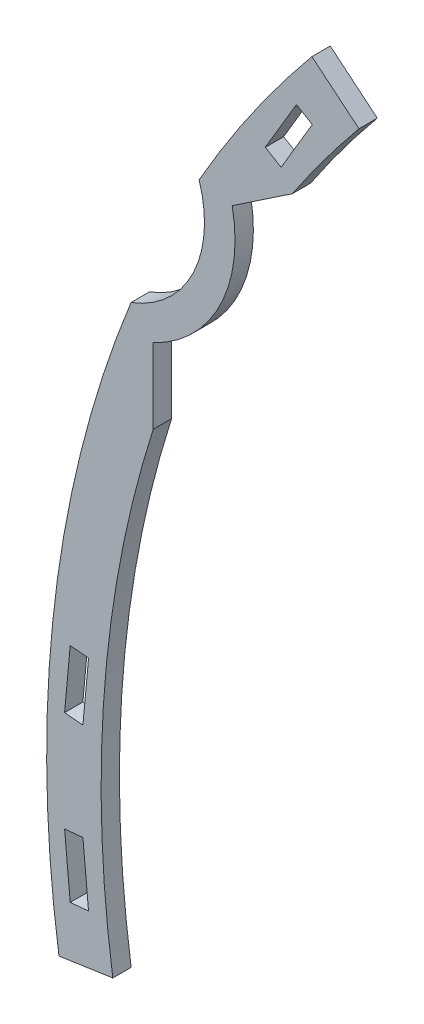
ISO-10303-21;
HEADER;
FILE_DESCRIPTION(('STEP AP214'),'2;1');
FILE_NAME('part.step','',(''),(''),'','','');
FILE_SCHEMA(('AUTOMOTIVE_DESIGN { 1 0 10303 214 1 1 1 1 }'));
ENDSEC;
DATA;
#1=APPLICATION_CONTEXT('core data for automotive mechanical design processes');
#2=APPLICATION_PROTOCOL_DEFINITION('international standard','automotive_design',2000,#1);
#3=PRODUCT_CONTEXT('',#1,'mechanical');
#4=PRODUCT('Part','Part','',(#3));
#5=PRODUCT_RELATED_PRODUCT_CATEGORY('part','',(#4));
#6=PRODUCT_DEFINITION_FORMATION('','',#4);
#7=PRODUCT_DEFINITION_CONTEXT('part definition',#1,'design');
#8=PRODUCT_DEFINITION('design','',#6,#7);
#9=PRODUCT_DEFINITION_SHAPE('','',#8);
#10=(LENGTH_UNIT() NAMED_UNIT(*) SI_UNIT(.MILLI.,.METRE.));
#11=(NAMED_UNIT(*) PLANE_ANGLE_UNIT() SI_UNIT($,.RADIAN.));
#12=(NAMED_UNIT(*) SI_UNIT($,.STERADIAN.) SOLID_ANGLE_UNIT());
#13=UNCERTAINTY_MEASURE_WITH_UNIT(LENGTH_MEASURE(1.E-05),#10,'distance_accuracy_value','');
#14=(GEOMETRIC_REPRESENTATION_CONTEXT(3) GLOBAL_UNCERTAINTY_ASSIGNED_CONTEXT((#13)) GLOBAL_UNIT_ASSIGNED_CONTEXT((#10,
#11,#12)) REPRESENTATION_CONTEXT('',''));
#15=CARTESIAN_POINT('',(0.,0.,0.));
#16=DIRECTION('',(0.,0.,1.));
#17=DIRECTION('',(1.,0.,0.));
#18=AXIS2_PLACEMENT_3D('',#15,#16,#17);
#19=CARTESIAN_POINT('',(-0.203284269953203,2.2058705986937,3.));
#20=DIRECTION('',(-0.091767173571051,0.995780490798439,0.));
#21=DIRECTION('',(-0.995780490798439,-0.091767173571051,0.));
#22=AXIS2_PLACEMENT_3D('',#19,#20,#21);
#23=PLANE('',#22);
#24=DIRECTION('',(0.995780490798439,0.091767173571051,0.));
#25=VECTOR('',#24,1.);
#26=CARTESIAN_POINT('',(-0.203284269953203,2.2058705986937,0.));
#27=LINE('',#26,#25);
#28=CARTESIAN_POINT('',(-186.36625925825,-14.9501695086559,0.));
#29=VERTEX_POINT('',#28);
#30=CARTESIAN_POINT('',(-183.36625925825,-14.6737014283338,0.));
#31=VERTEX_POINT('',#30);
#32=EDGE_CURVE('E266',#29,#31,#27,.T.);
#33=ORIENTED_EDGE('',*,*,#32,.T.);
#34=DIRECTION('',(0.,0.,-1.));
#35=VECTOR('',#34,1.);
#36=CARTESIAN_POINT('',(-183.36625925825,-14.6737014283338,3.));
#37=LINE('',#36,#35);
#38=CARTESIAN_POINT('',(-183.36625925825,-14.6737014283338,3.));
#39=VERTEX_POINT('',#38);
#40=EDGE_CURVE('E11',#39,#31,#37,.T.);
#41=ORIENTED_EDGE('',*,*,#40,.F.);
#42=DIRECTION('',(0.995780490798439,0.091767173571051,0.));
#43=VECTOR('',#42,1.);
#44=CARTESIAN_POINT('',(-0.203284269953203,2.2058705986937,3.));
#45=LINE('',#44,#43);
#46=CARTESIAN_POINT('',(-186.36625925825,-14.9501695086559,3.));
#47=VERTEX_POINT('',#46);
#48=EDGE_CURVE('E198',#47,#39,#45,.T.);
#49=ORIENTED_EDGE('',*,*,#48,.F.);
#50=DIRECTION('',(0.,0.,-1.));
#51=VECTOR('',#50,1.);
#52=CARTESIAN_POINT('',(-186.36625925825,-14.9501695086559,3.));
#53=LINE('',#52,#51);
#54=EDGE_CURVE('E54',#47,#29,#53,.T.);
#55=ORIENTED_EDGE('',*,*,#54,.T.);
#56=EDGE_LOOP('',(#33,#41,#49,#55));
#57=FACE_BOUND('',#56,.T.);
#58=ADVANCED_FACE('F35',(#57),#23,.F.);
#59=CARTESIAN_POINT('',(-183.162974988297,-16.8795720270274,3.));
#60=DIRECTION('',(0.995780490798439,0.0917671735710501,0.));
#61=DIRECTION('',(-0.0917671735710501,0.995780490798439,0.));
#62=AXIS2_PLACEMENT_3D('',#59,#60,#61);
#63=PLANE('',#62);
#64=DIRECTION('',(0.0917671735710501,-0.995780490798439,0.));
#65=VECTOR('',#64,1.);
#66=CARTESIAN_POINT('',(-183.162974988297,-16.8795720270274,0.));
#67=LINE('',#66,#65);
#68=CARTESIAN_POINT('',(-182.44858752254,-24.6315063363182,0.));
#69=VERTEX_POINT('',#68);
#70=EDGE_CURVE('E204',#31,#69,#67,.T.);
#71=ORIENTED_EDGE('',*,*,#70,.T.);
#72=DIRECTION('',(0.,0.,-1.));
#73=VECTOR('',#72,1.);
#74=CARTESIAN_POINT('',(-182.44858752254,-24.6315063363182,3.));
#75=LINE('',#74,#73);
#76=CARTESIAN_POINT('',(-182.44858752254,-24.6315063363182,3.));
#77=VERTEX_POINT('',#76);
#78=EDGE_CURVE('E45',#77,#69,#75,.T.);
#79=ORIENTED_EDGE('',*,*,#78,.F.);
#80=DIRECTION('',(0.0917671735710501,-0.995780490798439,0.));
#81=VECTOR('',#80,1.);
#82=CARTESIAN_POINT('',(-183.162974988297,-16.8795720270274,3.));
#83=LINE('',#82,#81);
#84=EDGE_CURVE('E192',#39,#77,#83,.T.);
#85=ORIENTED_EDGE('',*,*,#84,.F.);
#86=ORIENTED_EDGE('',*,*,#40,.T.);
#87=EDGE_LOOP('',(#71,#79,#85,#86));
#88=FACE_BOUND('',#87,.T.);
#89=ADVANCED_FACE('F203',(#88),#63,.F.);
#90=CARTESIAN_POINT('',(0.714387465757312,-7.7519343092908,3.));
#91=DIRECTION('',(-0.0917671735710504,0.995780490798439,0.));
#92=DIRECTION('',(-0.995780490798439,-0.0917671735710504,0.));
#93=AXIS2_PLACEMENT_3D('',#90,#91,#92);
#94=PLANE('',#93);
#95=DIRECTION('',(0.995780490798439,0.0917671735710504,0.));
#96=VECTOR('',#95,1.);
#97=CARTESIAN_POINT('',(0.714387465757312,-7.7519343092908,0.));
#98=LINE('',#97,#96);
#99=CARTESIAN_POINT('',(-185.44858752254,-24.9079744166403,0.));
#100=VERTEX_POINT('',#99);
#101=EDGE_CURVE('E269',#100,#69,#98,.T.);
#102=ORIENTED_EDGE('',*,*,#101,.F.);
#103=DIRECTION('',(0.,0.,-1.));
#104=VECTOR('',#103,1.);
#105=CARTESIAN_POINT('',(-185.44858752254,-24.9079744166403,3.));
#106=LINE('',#105,#104);
#107=CARTESIAN_POINT('',(-185.44858752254,-24.9079744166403,3.));
#108=VERTEX_POINT('',#107);
#109=EDGE_CURVE('E122',#108,#100,#106,.T.);
#110=ORIENTED_EDGE('',*,*,#109,.F.);
#111=DIRECTION('',(0.995780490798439,0.0917671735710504,0.));
#112=VECTOR('',#111,1.);
#113=CARTESIAN_POINT('',(0.714387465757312,-7.7519343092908,3.));
#114=LINE('',#113,#112);
#115=EDGE_CURVE('E197',#108,#77,#114,.T.);
#116=ORIENTED_EDGE('',*,*,#115,.T.);
#117=ORIENTED_EDGE('',*,*,#78,.T.);
#118=EDGE_LOOP('',(#102,#110,#116,#117));
#119=FACE_BOUND('',#118,.T.);
#120=ADVANCED_FACE('F208',(#119),#94,.T.);
#121=CARTESIAN_POINT('',(-0.512015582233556,-5.55596416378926,3.));
#122=DIRECTION('',(0.0917671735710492,0.995780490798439,0.));
#123=DIRECTION('',(-0.99578049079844,0.0917671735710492,0.));
#124=AXIS2_PLACEMENT_3D('',#121,#122,#123);
#125=PLANE('',#124);
#126=DIRECTION('',(0.995780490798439,-0.0917671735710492,0.));
#127=VECTOR('',#126,1.);
#128=CARTESIAN_POINT('',(-0.512015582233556,-5.55596416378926,0.));
#129=LINE('',#128,#127);
#130=CARTESIAN_POINT('',(-185.448587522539,11.4870555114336,0.));
#131=VERTEX_POINT('',#130);
#132=CARTESIAN_POINT('',(-182.448587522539,11.2105874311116,0.));
#133=VERTEX_POINT('',#132);
#134=EDGE_CURVE('E254',#131,#133,#129,.T.);
#135=ORIENTED_EDGE('',*,*,#134,.T.);
#136=DIRECTION('',(0.,0.,-1.));
#137=VECTOR('',#136,1.);
#138=CARTESIAN_POINT('',(-182.448587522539,11.2105874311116,3.));
#139=LINE('',#138,#137);
#140=CARTESIAN_POINT('',(-182.448587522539,11.2105874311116,3.));
#141=VERTEX_POINT('',#140);
#142=EDGE_CURVE('E276',#141,#133,#139,.T.);
#143=ORIENTED_EDGE('',*,*,#142,.F.);
#144=DIRECTION('',(0.995780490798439,-0.0917671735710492,0.));
#145=VECTOR('',#144,1.);
#146=CARTESIAN_POINT('',(-0.512015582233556,-5.55596416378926,3.));
#147=LINE('',#146,#145);
#148=CARTESIAN_POINT('',(-185.448587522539,11.4870555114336,3.));
#149=VERTEX_POINT('',#148);
#150=EDGE_CURVE('E392',#149,#141,#147,.T.);
#151=ORIENTED_EDGE('',*,*,#150,.F.);
#152=DIRECTION('',(0.,0.,-1.));
#153=VECTOR('',#152,1.);
#154=CARTESIAN_POINT('',(-185.448587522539,11.4870555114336,3.));
#155=LINE('',#154,#153);
#156=EDGE_CURVE('E278',#149,#131,#155,.T.);
#157=ORIENTED_EDGE('',*,*,#156,.T.);
#158=EDGE_LOOP('',(#135,#143,#151,#157));
#159=FACE_BOUND('',#158,.T.);
#160=ADVANCED_FACE('F418',(#159),#125,.F.);
#161=CARTESIAN_POINT('',(-181.936571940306,16.7665515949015,3.));
#162=DIRECTION('',(0.995780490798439,-0.0917671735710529,0.));
#163=DIRECTION('',(0.0917671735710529,0.995780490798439,0.));
#164=AXIS2_PLACEMENT_3D('',#161,#162,#163);
#165=PLANE('',#164);
#166=DIRECTION('',(-0.0917671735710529,-0.995780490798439,0.));
#167=VECTOR('',#166,1.);
#168=CARTESIAN_POINT('',(-181.936571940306,16.7665515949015,0.));
#169=LINE('',#168,#167);
#170=CARTESIAN_POINT('',(-183.36625925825,1.25278252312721,0.));
#171=VERTEX_POINT('',#170);
#172=EDGE_CURVE('E257',#133,#171,#169,.T.);
#173=ORIENTED_EDGE('',*,*,#172,.T.);
#174=DIRECTION('',(0.,0.,-1.));
#175=VECTOR('',#174,1.);
#176=CARTESIAN_POINT('',(-183.36625925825,1.25278252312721,3.));
#177=LINE('',#176,#175);
#178=CARTESIAN_POINT('',(-183.36625925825,1.25278252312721,3.));
#179=VERTEX_POINT('',#178);
#180=EDGE_CURVE('E283',#179,#171,#177,.T.);
#181=ORIENTED_EDGE('',*,*,#180,.F.);
#182=DIRECTION('',(-0.0917671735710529,-0.995780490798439,0.));
#183=VECTOR('',#182,1.);
#184=CARTESIAN_POINT('',(-181.936571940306,16.7665515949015,3.));
#185=LINE('',#184,#183);
#186=EDGE_CURVE('E395',#141,#179,#185,.T.);
#187=ORIENTED_EDGE('',*,*,#186,.F.);
#188=ORIENTED_EDGE('',*,*,#142,.T.);
#189=EDGE_LOOP('',(#173,#181,#187,#188));
#190=FACE_BOUND('',#189,.T.);
#191=ADVANCED_FACE('F420',(#190),#165,.F.);
#192=CARTESIAN_POINT('',(-1.42968731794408,-15.5137690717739,3.));
#193=DIRECTION('',(0.0917671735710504,0.995780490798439,0.));
#194=DIRECTION('',(-0.995780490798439,0.0917671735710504,0.));
#195=AXIS2_PLACEMENT_3D('',#192,#193,#194);
#196=PLANE('',#195);
#197=DIRECTION('',(0.995780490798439,-0.0917671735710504,0.));
#198=VECTOR('',#197,1.);
#199=CARTESIAN_POINT('',(-1.42968731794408,-15.5137690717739,0.));
#200=LINE('',#199,#198);
#201=CARTESIAN_POINT('',(-186.36625925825,1.52925060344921,0.));
#202=VERTEX_POINT('',#201);
#203=EDGE_CURVE('E260',#202,#171,#200,.T.);
#204=ORIENTED_EDGE('',*,*,#203,.F.);
#205=DIRECTION('',(0.,0.,-1.));
#206=VECTOR('',#205,1.);
#207=CARTESIAN_POINT('',(-186.36625925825,1.52925060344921,3.));
#208=LINE('',#207,#206);
#209=CARTESIAN_POINT('',(-186.36625925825,1.52925060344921,3.));
#210=VERTEX_POINT('',#209);
#211=EDGE_CURVE('E280',#210,#202,#208,.T.);
#212=ORIENTED_EDGE('',*,*,#211,.F.);
#213=DIRECTION('',(0.995780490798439,-0.0917671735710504,0.));
#214=VECTOR('',#213,1.);
#215=CARTESIAN_POINT('',(-1.42968731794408,-15.5137690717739,3.));
#216=LINE('',#215,#214);
#217=EDGE_CURVE('E397',#210,#179,#216,.T.);
#218=ORIENTED_EDGE('',*,*,#217,.T.);
#219=ORIENTED_EDGE('',*,*,#180,.T.);
#220=EDGE_LOOP('',(#204,#212,#218,#219));
#221=FACE_BOUND('',#220,.T.);
#222=ADVANCED_FACE('F413',(#221),#196,.T.);
#223=CARTESIAN_POINT('',(-154.080393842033,91.2060137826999,3.));
#224=DIRECTION('',(-0.860538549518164,0.509385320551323,0.));
#225=DIRECTION('',(-0.509385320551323,-0.860538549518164,0.));
#226=AXIS2_PLACEMENT_3D('',#223,#224,#225);
#227=PLANE('',#226);
#228=DIRECTION('',(0.509385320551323,0.860538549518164,0.));
#229=VECTOR('',#228,1.);
#230=CARTESIAN_POINT('',(-154.080393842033,91.2060137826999,0.));
#231=LINE('',#230,#229);
#232=CARTESIAN_POINT('',(-150.926255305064,96.5345100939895,0.));
#233=VERTEX_POINT('',#232);
#234=CARTESIAN_POINT('',(-145.832402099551,105.139895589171,0.));
#235=VERTEX_POINT('',#234);
#236=EDGE_CURVE('E242',#233,#235,#231,.T.);
#237=ORIENTED_EDGE('',*,*,#236,.F.);
#238=DIRECTION('',(0.,0.,-1.));
#239=VECTOR('',#238,1.);
#240=CARTESIAN_POINT('',(-150.926255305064,96.5345100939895,3.));
#241=LINE('',#240,#239);
#242=CARTESIAN_POINT('',(-150.926255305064,96.5345100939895,3.));
#243=VERTEX_POINT('',#242);
#244=EDGE_CURVE('E281',#243,#233,#241,.T.);
#245=ORIENTED_EDGE('',*,*,#244,.F.);
#246=DIRECTION('',(0.509385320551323,0.860538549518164,0.));
#247=VECTOR('',#246,1.);
#248=CARTESIAN_POINT('',(-154.080393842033,91.2060137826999,3.));
#249=LINE('',#248,#247);
#250=CARTESIAN_POINT('',(-145.832402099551,105.139895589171,3.));
#251=VERTEX_POINT('',#250);
#252=EDGE_CURVE('E381',#243,#251,#249,.T.);
#253=ORIENTED_EDGE('',*,*,#252,.T.);
#254=DIRECTION('',(0.,0.,-1.));
#255=VECTOR('',#254,1.);
#256=CARTESIAN_POINT('',(-145.832402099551,105.139895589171,3.));
#257=LINE('',#256,#255);
#258=EDGE_CURVE('E287',#251,#235,#257,.T.);
#259=ORIENTED_EDGE('',*,*,#258,.T.);
#260=EDGE_LOOP('',(#237,#245,#253,#259));
#261=FACE_BOUND('',#260,.T.);
#262=ADVANCED_FACE('F427',(#261),#227,.T.);
#263=CARTESIAN_POINT('',(3.15413853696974,5.32849631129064,3.));
#264=DIRECTION('',(0.509385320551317,0.860538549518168,0.));
#265=DIRECTION('',(-0.860538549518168,0.509385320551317,0.));
#266=AXIS2_PLACEMENT_3D('',#263,#264,#265);
#267=PLANE('',#266);
#268=DIRECTION('',(0.860538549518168,-0.509385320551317,0.));
#269=VECTOR('',#268,1.);
#270=CARTESIAN_POINT('',(3.15413853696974,5.32849631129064,0.));
#271=LINE('',#270,#269);
#272=CARTESIAN_POINT('',(-153.51881026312,98.0691414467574,0.));
#273=VERTEX_POINT('',#272);
#274=EDGE_CURVE('E245',#273,#233,#271,.T.);
#275=ORIENTED_EDGE('',*,*,#274,.F.);
#276=DIRECTION('',(0.,0.,-1.));
#277=VECTOR('',#276,1.);
#278=CARTESIAN_POINT('',(-153.51881026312,98.0691414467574,3.));
#279=LINE('',#278,#277);
#280=CARTESIAN_POINT('',(-153.51881026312,98.0691414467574,3.));
#281=VERTEX_POINT('',#280);
#282=EDGE_CURVE('E292',#281,#273,#279,.T.);
#283=ORIENTED_EDGE('',*,*,#282,.F.);
#284=DIRECTION('',(0.860538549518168,-0.509385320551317,0.));
#285=VECTOR('',#284,1.);
#286=CARTESIAN_POINT('',(3.15413853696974,5.32849631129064,3.));
#287=LINE('',#286,#285);
#288=EDGE_CURVE('E384',#281,#243,#287,.T.);
#289=ORIENTED_EDGE('',*,*,#288,.T.);
#290=ORIENTED_EDGE('',*,*,#244,.T.);
#291=EDGE_LOOP('',(#275,#283,#289,#290));
#292=FACE_BOUND('',#291,.T.);
#293=ADVANCED_FACE('F472',(#292),#267,.T.);
#294=CARTESIAN_POINT('',(-156.672948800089,92.7406451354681,3.));
#295=DIRECTION('',(-0.860538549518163,0.509385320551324,0.));
#296=DIRECTION('',(-0.509385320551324,-0.860538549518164,0.));
#297=AXIS2_PLACEMENT_3D('',#294,#295,#296);
#298=PLANE('',#297);
#299=DIRECTION('',(0.509385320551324,0.860538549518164,0.));
#300=VECTOR('',#299,1.);
#301=CARTESIAN_POINT('',(-156.672948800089,92.7406451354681,0.));
#302=LINE('',#301,#300);
#303=CARTESIAN_POINT('',(-148.424957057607,106.674526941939,0.));
#304=VERTEX_POINT('',#303);
#305=EDGE_CURVE('E248',#273,#304,#302,.T.);
#306=ORIENTED_EDGE('',*,*,#305,.T.);
#307=DIRECTION('',(0.,0.,-1.));
#308=VECTOR('',#307,1.);
#309=CARTESIAN_POINT('',(-148.424957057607,106.674526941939,3.));
#310=LINE('',#309,#308);
#311=CARTESIAN_POINT('',(-148.424957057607,106.674526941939,3.));
#312=VERTEX_POINT('',#311);
#313=EDGE_CURVE('E289',#312,#304,#310,.T.);
#314=ORIENTED_EDGE('',*,*,#313,.F.);
#315=DIRECTION('',(0.509385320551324,0.860538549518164,0.));
#316=VECTOR('',#315,1.);
#317=CARTESIAN_POINT('',(-156.672948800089,92.7406451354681,3.));
#318=LINE('',#317,#316);
#319=EDGE_CURVE('E387',#281,#312,#318,.T.);
#320=ORIENTED_EDGE('',*,*,#319,.F.);
#321=ORIENTED_EDGE('',*,*,#282,.T.);
#322=EDGE_LOOP('',(#306,#314,#320,#321));
#323=FACE_BOUND('',#322,.T.);
#324=ADVANCED_FACE('F468',(#323),#298,.F.);
#325=CARTESIAN_POINT('',(0.,-5.88022373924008,3.));
#326=DIRECTION('',(0.,0.,-1.));
#327=DIRECTION('',(-1.,0.,0.));
#328=AXIS2_PLACEMENT_3D('',#325,#326,#327);
#329=CYLINDRICAL_SURFACE('',#328,180.393138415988);
#330=CARTESIAN_POINT('',(0.,-5.88022373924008,0.));
#331=DIRECTION('',(0.,0.,1.));
#332=DIRECTION('',(1.,0.,0.));
#333=AXIS2_PLACEMENT_3D('',#330,#331,#332);
#334=CIRCLE('',#333,180.393138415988);
#335=CARTESIAN_POINT('',(-171.863347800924,48.9346836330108,0.));
#336=VERTEX_POINT('',#335);
#337=CARTESIAN_POINT('',(-178.471928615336,-32.1377004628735,0.));
#338=VERTEX_POINT('',#337);
#339=EDGE_CURVE('E215',#336,#338,#334,.T.);
#340=ORIENTED_EDGE('',*,*,#339,.F.);
#341=DIRECTION('',(0.,0.,-1.));
#342=VECTOR('',#341,1.);
#343=CARTESIAN_POINT('',(-171.863347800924,48.9346836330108,3.));
#344=LINE('',#343,#342);
#345=CARTESIAN_POINT('',(-171.863347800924,48.9346836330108,3.));
#346=VERTEX_POINT('',#345);
#347=EDGE_CURVE('E39',#346,#336,#344,.T.);
#348=ORIENTED_EDGE('',*,*,#347,.F.);
#349=CARTESIAN_POINT('',(0.,-5.88022373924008,3.));
#350=DIRECTION('',(0.,0.,1.));
#351=DIRECTION('',(1.,0.,0.));
#352=AXIS2_PLACEMENT_3D('',#349,#350,#351);
#353=CIRCLE('',#352,180.393138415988);
#354=CARTESIAN_POINT('',(-178.471928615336,-32.1377004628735,3.));
#355=VERTEX_POINT('',#354);
#356=EDGE_CURVE('E274',#346,#355,#353,.T.);
#357=ORIENTED_EDGE('',*,*,#356,.T.);
#358=DIRECTION('',(0.,0.,-1.));
#359=VECTOR('',#358,1.);
#360=CARTESIAN_POINT('',(-178.471928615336,-32.1377004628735,3.));
#361=LINE('',#360,#359);
#362=EDGE_CURVE('E211',#355,#338,#361,.T.);
#363=ORIENTED_EDGE('',*,*,#362,.T.);
#364=EDGE_LOOP('',(#340,#348,#357,#363));
#365=FACE_BOUND('',#364,.T.);
#366=ADVANCED_FACE('F37',(#365),#329,.F.);
#367=CARTESIAN_POINT('',(-171.863347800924,0.,3.));
#368=DIRECTION('',(-1.,0.,0.));
#369=DIRECTION('',(0.,0.,1.));
#370=AXIS2_PLACEMENT_3D('',#367,#368,#369);
#371=PLANE('',#370);
#372=DIRECTION('',(0.,1.,0.));
#373=VECTOR('',#372,1.);
#374=CARTESIAN_POINT('',(-171.863347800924,0.,0.));
#375=LINE('',#374,#373);
#376=CARTESIAN_POINT('',(-171.863347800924,61.2060859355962,0.));
#377=VERTEX_POINT('',#376);
#378=EDGE_CURVE('E218',#336,#377,#375,.T.);
#379=ORIENTED_EDGE('',*,*,#378,.T.);
#380=DIRECTION('',(0.,0.,-1.));
#381=VECTOR('',#380,1.);
#382=CARTESIAN_POINT('',(-171.863347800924,61.2060859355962,3.));
#383=LINE('',#382,#381);
#384=CARTESIAN_POINT('',(-171.863347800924,61.2060859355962,3.));
#385=VERTEX_POINT('',#384);
#386=EDGE_CURVE('E311',#385,#377,#383,.T.);
#387=ORIENTED_EDGE('',*,*,#386,.F.);
#388=DIRECTION('',(0.,1.,0.));
#389=VECTOR('',#388,1.);
#390=CARTESIAN_POINT('',(-171.863347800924,0.,3.));
#391=LINE('',#390,#389);
#392=EDGE_CURVE('E320',#346,#385,#391,.T.);
#393=ORIENTED_EDGE('',*,*,#392,.F.);
#394=ORIENTED_EDGE('',*,*,#347,.T.);
#395=EDGE_LOOP('',(#379,#387,#393,#394));
#396=FACE_BOUND('',#395,.T.);
#397=ADVANCED_FACE('F319',(#396),#371,.F.);
#398=CARTESIAN_POINT('',(-181.970238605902,82.4216641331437,3.));
#399=DIRECTION('',(0.,0.,-1.));
#400=DIRECTION('',(-1.,0.,0.));
#401=AXIS2_PLACEMENT_3D('',#398,#399,#400);
#402=CYLINDRICAL_SURFACE('',#401,23.5);
#403=CARTESIAN_POINT('',(-181.970238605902,82.4216641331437,0.));
#404=DIRECTION('',(0.,0.,1.));
#405=DIRECTION('',(1.,0.,0.));
#406=AXIS2_PLACEMENT_3D('',#403,#404,#405);
#407=CIRCLE('',#406,23.5);
#408=CARTESIAN_POINT('',(-158.939001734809,87.0920097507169,0.));
#409=VERTEX_POINT('',#408);
#410=EDGE_CURVE('E220',#377,#409,#407,.T.);
#411=ORIENTED_EDGE('',*,*,#410,.T.);
#412=DIRECTION('',(0.,0.,-1.));
#413=VECTOR('',#412,1.);
#414=CARTESIAN_POINT('',(-158.939001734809,87.0920097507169,3.));
#415=LINE('',#414,#413);
#416=CARTESIAN_POINT('',(-158.939001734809,87.0920097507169,3.));
#417=VERTEX_POINT('',#416);
#418=EDGE_CURVE('E309',#417,#409,#415,.T.);
#419=ORIENTED_EDGE('',*,*,#418,.F.);
#420=CARTESIAN_POINT('',(-181.970238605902,82.4216641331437,3.));
#421=DIRECTION('',(0.,0.,1.));
#422=DIRECTION('',(1.,0.,0.));
#423=AXIS2_PLACEMENT_3D('',#420,#421,#422);
#424=CIRCLE('',#423,23.5);
#425=EDGE_CURVE('E364',#385,#417,#424,.T.);
#426=ORIENTED_EDGE('',*,*,#425,.F.);
#427=ORIENTED_EDGE('',*,*,#386,.T.);
#428=EDGE_LOOP('',(#411,#419,#426,#427));
#429=FACE_BOUND('',#428,.T.);
#430=ADVANCED_FACE('F363',(#429),#402,.T.);
#431=CARTESIAN_POINT('',(-89.6874811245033,133.586268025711,3.));
#432=DIRECTION('',(-0.557407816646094,0.830238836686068,0.));
#433=DIRECTION('',(-0.830238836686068,-0.557407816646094,0.));
#434=AXIS2_PLACEMENT_3D('',#431,#432,#433);
#435=PLANE('',#434);
#436=DIRECTION('',(0.830238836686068,0.557407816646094,0.));
#437=VECTOR('',#436,1.);
#438=CARTESIAN_POINT('',(-89.6874811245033,133.586268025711,0.));
#439=LINE('',#438,#437);
#440=CARTESIAN_POINT('',(-149.111601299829,93.6899543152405,0.));
#441=VERTEX_POINT('',#440);
#442=EDGE_CURVE('E222',#409,#441,#439,.T.);
#443=ORIENTED_EDGE('',*,*,#442,.T.);
#444=DIRECTION('',(0.,0.,-1.));
#445=VECTOR('',#444,1.);
#446=CARTESIAN_POINT('',(-149.111601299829,93.6899543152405,3.));
#447=LINE('',#446,#445);
#448=CARTESIAN_POINT('',(-149.111601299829,93.6899543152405,3.));
#449=VERTEX_POINT('',#448);
#450=EDGE_CURVE('E307',#449,#441,#447,.T.);
#451=ORIENTED_EDGE('',*,*,#450,.F.);
#452=DIRECTION('',(0.830238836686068,0.557407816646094,0.));
#453=VECTOR('',#452,1.);
#454=CARTESIAN_POINT('',(-89.6874811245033,133.586268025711,3.));
#455=LINE('',#454,#453);
#456=EDGE_CURVE('E362',#417,#449,#455,.T.);
#457=ORIENTED_EDGE('',*,*,#456,.F.);
#458=ORIENTED_EDGE('',*,*,#418,.T.);
#459=EDGE_LOOP('',(#443,#451,#457,#458));
#460=FACE_BOUND('',#459,.T.);
#461=ADVANCED_FACE('F359',(#460),#435,.F.);
#462=CARTESIAN_POINT('',(0.,-5.88022373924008,3.));
#463=DIRECTION('',(0.,0.,-1.));
#464=DIRECTION('',(-1.,0.,0.));
#465=AXIS2_PLACEMENT_3D('',#462,#463,#464);
#466=CYLINDRICAL_SURFACE('',#465,179.3);
#467=CARTESIAN_POINT('',(0.,-5.88022373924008,0.));
#468=DIRECTION('',(0.,0.,1.));
#469=DIRECTION('',(1.,0.,0.));
#470=AXIS2_PLACEMENT_3D('',#467,#468,#469);
#471=CIRCLE('',#470,179.3);
#472=CARTESIAN_POINT('',(-138.186060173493,108.369952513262,0.));
#473=VERTEX_POINT('',#472);
#474=EDGE_CURVE('E225',#473,#441,#471,.T.);
#475=ORIENTED_EDGE('',*,*,#474,.F.);
#476=DIRECTION('',(0.,0.,-1.));
#477=VECTOR('',#476,1.);
#478=CARTESIAN_POINT('',(-138.186060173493,108.369952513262,3.));
#479=LINE('',#478,#477);
#480=CARTESIAN_POINT('',(-138.186060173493,108.369952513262,3.));
#481=VERTEX_POINT('',#480);
#482=EDGE_CURVE('E305',#481,#473,#479,.T.);
#483=ORIENTED_EDGE('',*,*,#482,.F.);
#484=CARTESIAN_POINT('',(0.,-5.88022373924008,3.));
#485=DIRECTION('',(0.,0.,1.));
#486=DIRECTION('',(1.,0.,0.));
#487=AXIS2_PLACEMENT_3D('',#484,#485,#486);
#488=CIRCLE('',#487,179.3);
#489=EDGE_CURVE('E367',#481,#449,#488,.T.);
#490=ORIENTED_EDGE('',*,*,#489,.T.);
#491=ORIENTED_EDGE('',*,*,#450,.T.);
#492=EDGE_LOOP('',(#475,#483,#490,#491));
#493=FACE_BOUND('',#492,.T.);
#494=ADVANCED_FACE('F356',(#493),#466,.F.);
#495=CARTESIAN_POINT('',(-2.88771537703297,-3.49270367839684,3.));
#496=DIRECTION('',(0.63720120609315,0.770697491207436,0.));
#497=DIRECTION('',(-0.770697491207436,0.63720120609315,0.));
#498=AXIS2_PLACEMENT_3D('',#495,#496,#497);
#499=PLANE('',#498);
#500=DIRECTION('',(0.770697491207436,-0.63720120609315,0.));
#501=VECTOR('',#500,1.);
#502=CARTESIAN_POINT('',(-2.88771537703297,-3.49270367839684,0.));
#503=LINE('',#502,#501);
#504=CARTESIAN_POINT('',(-145.893035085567,114.741964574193,0.));
#505=VERTEX_POINT('',#504);
#506=EDGE_CURVE('E228',#505,#473,#503,.T.);
#507=ORIENTED_EDGE('',*,*,#506,.F.);
#508=DIRECTION('',(0.,0.,-1.));
#509=VECTOR('',#508,1.);
#510=CARTESIAN_POINT('',(-145.893035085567,114.741964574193,3.));
#511=LINE('',#510,#509);
#512=CARTESIAN_POINT('',(-145.893035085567,114.741964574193,3.));
#513=VERTEX_POINT('',#512);
#514=EDGE_CURVE('E303',#513,#505,#511,.T.);
#515=ORIENTED_EDGE('',*,*,#514,.F.);
#516=DIRECTION('',(0.770697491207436,-0.63720120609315,0.));
#517=VECTOR('',#516,1.);
#518=CARTESIAN_POINT('',(-2.88771537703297,-3.49270367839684,3.));
#519=LINE('',#518,#517);
#520=EDGE_CURVE('E352',#513,#481,#519,.T.);
#521=ORIENTED_EDGE('',*,*,#520,.T.);
#522=ORIENTED_EDGE('',*,*,#482,.T.);
#523=EDGE_LOOP('',(#507,#515,#521,#522));
#524=FACE_BOUND('',#523,.T.);
#525=ADVANCED_FACE('F348',(#524),#499,.T.);
#526=CARTESIAN_POINT('',(0.,-5.88022373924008,3.));
#527=DIRECTION('',(0.,0.,-1.));
#528=DIRECTION('',(-1.,0.,0.));
#529=AXIS2_PLACEMENT_3D('',#526,#527,#528);
#530=CYLINDRICAL_SURFACE('',#529,189.3);
#531=CARTESIAN_POINT('',(0.,-5.88022373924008,0.));
#532=DIRECTION('',(0.,0.,1.));
#533=DIRECTION('',(1.,0.,0.));
#534=AXIS2_PLACEMENT_3D('',#531,#532,#533);
#535=CIRCLE('',#534,189.3);
#536=CARTESIAN_POINT('',(-164.348940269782,88.0554767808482,0.));
#537=VERTEX_POINT('',#536);
#538=EDGE_CURVE('E231',#505,#537,#535,.T.);
#539=ORIENTED_EDGE('',*,*,#538,.T.);
#540=DIRECTION('',(0.,0.,-1.));
#541=VECTOR('',#540,1.);
#542=CARTESIAN_POINT('',(-164.348940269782,88.0554767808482,3.));
#543=LINE('',#542,#541);
#544=CARTESIAN_POINT('',(-164.348940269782,88.0554767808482,3.));
#545=VERTEX_POINT('',#544);
#546=EDGE_CURVE('E301',#545,#537,#543,.T.);
#547=ORIENTED_EDGE('',*,*,#546,.F.);
#548=CARTESIAN_POINT('',(0.,-5.88022373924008,3.));
#549=DIRECTION('',(0.,0.,1.));
#550=DIRECTION('',(1.,0.,0.));
#551=AXIS2_PLACEMENT_3D('',#548,#549,#550);
#552=CIRCLE('',#551,189.3);
#553=EDGE_CURVE('E374',#513,#545,#552,.T.);
#554=ORIENTED_EDGE('',*,*,#553,.F.);
#555=ORIENTED_EDGE('',*,*,#514,.T.);
#556=EDGE_LOOP('',(#539,#547,#554,#555));
#557=FACE_BOUND('',#556,.T.);
#558=ADVANCED_FACE('F345',(#557),#530,.T.);
#559=CARTESIAN_POINT('',(-181.970238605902,82.4216641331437,3.));
#560=DIRECTION('',(0.,0.,-1.));
#561=DIRECTION('',(-1.,0.,0.));
#562=AXIS2_PLACEMENT_3D('',#559,#560,#561);
#563=CYLINDRICAL_SURFACE('',#562,18.5);
#564=CARTESIAN_POINT('',(-181.970238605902,82.4216641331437,0.));
#565=DIRECTION('',(0.,0.,1.));
#566=DIRECTION('',(1.,0.,0.));
#567=AXIS2_PLACEMENT_3D('',#564,#565,#566);
#568=CIRCLE('',#567,18.5);
#569=CARTESIAN_POINT('',(-175.491492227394,65.0931949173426,0.));
#570=VERTEX_POINT('',#569);
#571=EDGE_CURVE('E234',#570,#537,#568,.T.);
#572=ORIENTED_EDGE('',*,*,#571,.F.);
#573=DIRECTION('',(0.,0.,-1.));
#574=VECTOR('',#573,1.);
#575=CARTESIAN_POINT('',(-175.491492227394,65.0931949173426,3.));
#576=LINE('',#575,#574);
#577=CARTESIAN_POINT('',(-175.491492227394,65.0931949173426,3.));
#578=VERTEX_POINT('',#577);
#579=EDGE_CURVE('E299',#578,#570,#576,.T.);
#580=ORIENTED_EDGE('',*,*,#579,.F.);
#581=CARTESIAN_POINT('',(-181.970238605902,82.4216641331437,3.));
#582=DIRECTION('',(0.,0.,1.));
#583=DIRECTION('',(1.,0.,0.));
#584=AXIS2_PLACEMENT_3D('',#581,#582,#583);
#585=CIRCLE('',#584,18.5);
#586=EDGE_CURVE('E342',#578,#545,#585,.T.);
#587=ORIENTED_EDGE('',*,*,#586,.T.);
#588=ORIENTED_EDGE('',*,*,#546,.T.);
#589=EDGE_LOOP('',(#572,#580,#587,#588));
#590=FACE_BOUND('',#589,.T.);
#591=ADVANCED_FACE('F337',(#590),#563,.F.);
#592=CARTESIAN_POINT('',(0.,-5.88022373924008,3.));
#593=DIRECTION('',(0.,0.,-1.));
#594=DIRECTION('',(-1.,0.,0.));
#595=AXIS2_PLACEMENT_3D('',#592,#593,#594);
#596=CYLINDRICAL_SURFACE('',#595,189.3);
#597=CARTESIAN_POINT('',(0.,-5.88022373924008,0.));
#598=DIRECTION('',(0.,0.,1.));
#599=DIRECTION('',(1.,0.,0.));
#600=AXIS2_PLACEMENT_3D('',#597,#598,#599);
#601=CIRCLE('',#600,189.3);
#602=CARTESIAN_POINT('',(-187.283930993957,-33.4341561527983,0.));
#603=VERTEX_POINT('',#602);
#604=EDGE_CURVE('E237',#570,#603,#601,.T.);
#605=ORIENTED_EDGE('',*,*,#604,.T.);
#606=DIRECTION('',(0.,0.,-1.));
#607=VECTOR('',#606,1.);
#608=CARTESIAN_POINT('',(-187.283930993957,-33.4341561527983,3.));
#609=LINE('',#608,#607);
#610=CARTESIAN_POINT('',(-187.283930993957,-33.4341561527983,3.));
#611=VERTEX_POINT('',#610);
#612=EDGE_CURVE('E296',#611,#603,#609,.T.);
#613=ORIENTED_EDGE('',*,*,#612,.F.);
#614=CARTESIAN_POINT('',(0.,-5.88022373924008,3.));
#615=DIRECTION('',(0.,0.,1.));
#616=DIRECTION('',(1.,0.,0.));
#617=AXIS2_PLACEMENT_3D('',#614,#615,#616);
#618=CIRCLE('',#617,189.3);
#619=EDGE_CURVE('E377',#578,#611,#618,.T.);
#620=ORIENTED_EDGE('',*,*,#619,.F.);
#621=ORIENTED_EDGE('',*,*,#579,.T.);
#622=EDGE_LOOP('',(#605,#613,#620,#621));
#623=FACE_BOUND('',#622,.T.);
#624=ADVANCED_FACE('F440',(#623),#596,.T.);
#625=CARTESIAN_POINT('',(-184.936571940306,17.0430196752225,3.));
#626=DIRECTION('',(0.995780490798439,-0.0917671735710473,0.));
#627=DIRECTION('',(0.0917671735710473,0.99578049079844,0.));
#628=AXIS2_PLACEMENT_3D('',#625,#626,#627);
#629=PLANE('',#628);
#630=DIRECTION('',(-0.0917671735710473,-0.99578049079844,0.));
#631=VECTOR('',#630,1.);
#632=CARTESIAN_POINT('',(-184.936571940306,17.0430196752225,0.));
#633=LINE('',#632,#631);
#634=EDGE_CURVE('E263',#131,#202,#633,.T.);
#635=ORIENTED_EDGE('',*,*,#634,.F.);
#636=ORIENTED_EDGE('',*,*,#156,.F.);
#637=DIRECTION('',(-0.0917671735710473,-0.99578049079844,0.));
#638=VECTOR('',#637,1.);
#639=CARTESIAN_POINT('',(-184.936571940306,17.0430196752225,3.));
#640=LINE('',#639,#638);
#641=EDGE_CURVE('E400',#149,#210,#640,.T.);
#642=ORIENTED_EDGE('',*,*,#641,.T.);
#643=ORIENTED_EDGE('',*,*,#211,.T.);
#644=EDGE_LOOP('',(#635,#636,#642,#643));
#645=FACE_BOUND('',#644,.T.);
#646=ADVANCED_FACE('F405',(#645),#629,.T.);
#647=CARTESIAN_POINT('',(8.24799174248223,13.9338818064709,3.));
#648=DIRECTION('',(0.509385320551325,0.860538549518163,0.));
#649=DIRECTION('',(-0.860538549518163,0.509385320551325,0.));
#650=AXIS2_PLACEMENT_3D('',#647,#648,#649);
#651=PLANE('',#650);
#652=DIRECTION('',(0.860538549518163,-0.509385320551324,0.));
#653=VECTOR('',#652,1.);
#654=CARTESIAN_POINT('',(8.24799174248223,13.9338818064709,0.));
#655=LINE('',#654,#653);
#656=EDGE_CURVE('E251',#304,#235,#655,.T.);
#657=ORIENTED_EDGE('',*,*,#656,.T.);
#658=ORIENTED_EDGE('',*,*,#258,.F.);
#659=DIRECTION('',(0.860538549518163,-0.509385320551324,0.));
#660=VECTOR('',#659,1.);
#661=CARTESIAN_POINT('',(8.24799174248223,13.9338818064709,3.));
#662=LINE('',#661,#660);
#663=EDGE_CURVE('E390',#312,#251,#662,.T.);
#664=ORIENTED_EDGE('',*,*,#663,.F.);
#665=ORIENTED_EDGE('',*,*,#313,.T.);
#666=EDGE_LOOP('',(#657,#658,#664,#665));
#667=FACE_BOUND('',#666,.T.);
#668=ADVANCED_FACE('F439',(#667),#651,.F.);
#669=CARTESIAN_POINT('',(0.846791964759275,-5.75564044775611,3.));
#670=DIRECTION('',(-0.145556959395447,0.98934987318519,0.));
#671=DIRECTION('',(-0.98934987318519,-0.145556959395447,0.));
#672=AXIS2_PLACEMENT_3D('',#669,#670,#671);
#673=PLANE('',#672);
#674=DIRECTION('',(0.98934987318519,0.145556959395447,0.));
#675=VECTOR('',#674,1.);
#676=CARTESIAN_POINT('',(0.846791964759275,-5.75564044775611,0.));
#677=LINE('',#676,#675);
#678=EDGE_CURVE('E239',#603,#338,#677,.T.);
#679=ORIENTED_EDGE('',*,*,#678,.T.);
#680=ORIENTED_EDGE('',*,*,#362,.F.);
#681=DIRECTION('',(0.98934987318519,0.145556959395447,0.));
#682=VECTOR('',#681,1.);
#683=CARTESIAN_POINT('',(0.846791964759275,-5.75564044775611,3.));
#684=LINE('',#683,#682);
#685=EDGE_CURVE('E379',#611,#355,#684,.T.);
#686=ORIENTED_EDGE('',*,*,#685,.F.);
#687=ORIENTED_EDGE('',*,*,#612,.T.);
#688=EDGE_LOOP('',(#679,#680,#686,#687));
#689=FACE_BOUND('',#688,.T.);
#690=ADVANCED_FACE('F330',(#689),#673,.F.);
#691=CARTESIAN_POINT('',(-186.162974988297,-17.1560401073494,3.));
#692=DIRECTION('',(0.995780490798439,0.0917671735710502,0.));
#693=DIRECTION('',(-0.0917671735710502,0.995780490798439,0.));
#694=AXIS2_PLACEMENT_3D('',#691,#692,#693);
#695=PLANE('',#694);
#696=DIRECTION('',(0.0917671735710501,-0.995780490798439,0.));
#697=VECTOR('',#696,1.);
#698=CARTESIAN_POINT('',(-186.162974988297,-17.1560401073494,0.));
#699=LINE('',#698,#697);
#700=EDGE_CURVE('E271',#29,#100,#699,.T.);
#701=ORIENTED_EDGE('',*,*,#700,.F.);
#702=ORIENTED_EDGE('',*,*,#54,.F.);
#703=DIRECTION('',(0.0917671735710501,-0.995780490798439,0.));
#704=VECTOR('',#703,1.);
#705=CARTESIAN_POINT('',(-186.162974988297,-17.1560401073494,3.));
#706=LINE('',#705,#704);
#707=EDGE_CURVE('E209',#47,#108,#706,.T.);
#708=ORIENTED_EDGE('',*,*,#707,.T.);
#709=ORIENTED_EDGE('',*,*,#109,.T.);
#710=EDGE_LOOP('',(#701,#702,#708,#709));
#711=FACE_BOUND('',#710,.T.);
#712=ADVANCED_FACE('F494',(#711),#695,.T.);
#713=CARTESIAN_POINT('',(0.,0.,3.));
#714=DIRECTION('',(0.,0.,1.));
#715=DIRECTION('',(1.,0.,0.));
#716=AXIS2_PLACEMENT_3D('',#713,#714,#715);
#717=PLANE('',#716);
#718=ORIENTED_EDGE('',*,*,#356,.F.);
#719=ORIENTED_EDGE('',*,*,#392,.T.);
#720=ORIENTED_EDGE('',*,*,#425,.T.);
#721=ORIENTED_EDGE('',*,*,#456,.T.);
#722=ORIENTED_EDGE('',*,*,#489,.F.);
#723=ORIENTED_EDGE('',*,*,#520,.F.);
#724=ORIENTED_EDGE('',*,*,#553,.T.);
#725=ORIENTED_EDGE('',*,*,#586,.F.);
#726=ORIENTED_EDGE('',*,*,#619,.T.);
#727=ORIENTED_EDGE('',*,*,#685,.T.);
#728=EDGE_LOOP('',(#718,#719,#720,#721,#722,#723,#724,#725,#726,#727));
#729=FACE_BOUND('',#728,.T.);
#730=ORIENTED_EDGE('',*,*,#252,.F.);
#731=ORIENTED_EDGE('',*,*,#288,.F.);
#732=ORIENTED_EDGE('',*,*,#319,.T.);
#733=ORIENTED_EDGE('',*,*,#663,.T.);
#734=EDGE_LOOP('',(#730,#731,#732,#733));
#735=FACE_BOUND('',#734,.T.);
#736=ORIENTED_EDGE('',*,*,#150,.T.);
#737=ORIENTED_EDGE('',*,*,#186,.T.);
#738=ORIENTED_EDGE('',*,*,#217,.F.);
#739=ORIENTED_EDGE('',*,*,#641,.F.);
#740=EDGE_LOOP('',(#736,#737,#738,#739));
#741=FACE_BOUND('',#740,.T.);
#742=ORIENTED_EDGE('',*,*,#48,.T.);
#743=ORIENTED_EDGE('',*,*,#84,.T.);
#744=ORIENTED_EDGE('',*,*,#115,.F.);
#745=ORIENTED_EDGE('',*,*,#707,.F.);
#746=EDGE_LOOP('',(#742,#743,#744,#745));
#747=FACE_BOUND('',#746,.T.);
#748=ADVANCED_FACE('F194',(#729,#735,#741,#747),#717,.T.);
#749=CARTESIAN_POINT('',(0.,0.,0.));
#750=DIRECTION('',(0.,0.,1.));
#751=DIRECTION('',(1.,0.,0.));
#752=AXIS2_PLACEMENT_3D('',#749,#750,#751);
#753=PLANE('',#752);
#754=ORIENTED_EDGE('',*,*,#339,.T.);
#755=ORIENTED_EDGE('',*,*,#678,.F.);
#756=ORIENTED_EDGE('',*,*,#604,.F.);
#757=ORIENTED_EDGE('',*,*,#571,.T.);
#758=ORIENTED_EDGE('',*,*,#538,.F.);
#759=ORIENTED_EDGE('',*,*,#506,.T.);
#760=ORIENTED_EDGE('',*,*,#474,.T.);
#761=ORIENTED_EDGE('',*,*,#442,.F.);
#762=ORIENTED_EDGE('',*,*,#410,.F.);
#763=ORIENTED_EDGE('',*,*,#378,.F.);
#764=EDGE_LOOP('',(#754,#755,#756,#757,#758,#759,#760,#761,#762,#763));
#765=FACE_BOUND('',#764,.T.);
#766=ORIENTED_EDGE('',*,*,#236,.T.);
#767=ORIENTED_EDGE('',*,*,#656,.F.);
#768=ORIENTED_EDGE('',*,*,#305,.F.);
#769=ORIENTED_EDGE('',*,*,#274,.T.);
#770=EDGE_LOOP('',(#766,#767,#768,#769));
#771=FACE_BOUND('',#770,.T.);
#772=ORIENTED_EDGE('',*,*,#134,.F.);
#773=ORIENTED_EDGE('',*,*,#634,.T.);
#774=ORIENTED_EDGE('',*,*,#203,.T.);
#775=ORIENTED_EDGE('',*,*,#172,.F.);
#776=EDGE_LOOP('',(#772,#773,#774,#775));
#777=FACE_BOUND('',#776,.T.);
#778=ORIENTED_EDGE('',*,*,#32,.F.);
#779=ORIENTED_EDGE('',*,*,#700,.T.);
#780=ORIENTED_EDGE('',*,*,#101,.T.);
#781=ORIENTED_EDGE('',*,*,#70,.F.);
#782=EDGE_LOOP('',(#778,#779,#780,#781));
#783=FACE_BOUND('',#782,.T.);
#784=ADVANCED_FACE('F323',(#765,#771,#777,#783),#753,.F.);
#785=CLOSED_SHELL('',(#58,#89,#120,#160,#191,#222,#262,#293,#324,#366,#397,#430,#461,#494,#525,
#558,#591,#624,#646,#668,#690,#712,#748,#784));
#786=MANIFOLD_SOLID_BREP('B2',#785);
#787=ADVANCED_BREP_SHAPE_REPRESENTATION('',(#18,#786),#14);
#788=SHAPE_DEFINITION_REPRESENTATION(#9,#787);
ENDSEC;
END-ISO-10303-21;
